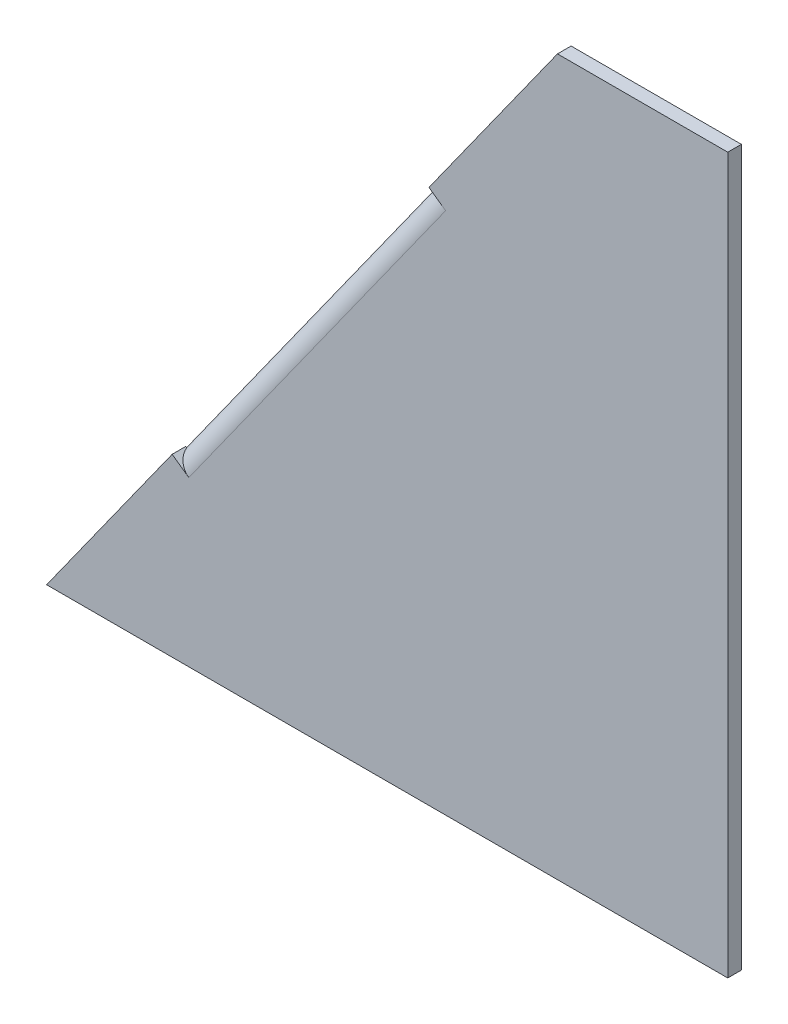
ISO-10303-21;
HEADER;
FILE_DESCRIPTION(('STEP AP214'),'2;1');
FILE_NAME('part.step','',(''),(''),'','','');
FILE_SCHEMA(('AUTOMOTIVE_DESIGN { 1 0 10303 214 1 1 1 1 }'));
ENDSEC;
DATA;
#1=APPLICATION_CONTEXT('core data for automotive mechanical design processes');
#2=APPLICATION_PROTOCOL_DEFINITION('international standard','automotive_design',2000,#1);
#3=PRODUCT_CONTEXT('',#1,'mechanical');
#4=PRODUCT('Part','Part','',(#3));
#5=PRODUCT_RELATED_PRODUCT_CATEGORY('part','',(#4));
#6=PRODUCT_DEFINITION_FORMATION('','',#4);
#7=PRODUCT_DEFINITION_CONTEXT('part definition',#1,'design');
#8=PRODUCT_DEFINITION('design','',#6,#7);
#9=PRODUCT_DEFINITION_SHAPE('','',#8);
#10=(LENGTH_UNIT() NAMED_UNIT(*) SI_UNIT(.MILLI.,.METRE.));
#11=(NAMED_UNIT(*) PLANE_ANGLE_UNIT() SI_UNIT($,.RADIAN.));
#12=(NAMED_UNIT(*) SI_UNIT($,.STERADIAN.) SOLID_ANGLE_UNIT());
#13=UNCERTAINTY_MEASURE_WITH_UNIT(LENGTH_MEASURE(1.E-05),#10,'distance_accuracy_value','');
#14=(GEOMETRIC_REPRESENTATION_CONTEXT(3) GLOBAL_UNCERTAINTY_ASSIGNED_CONTEXT((#13)) GLOBAL_UNIT_ASSIGNED_CONTEXT((#10,
#11,#12)) REPRESENTATION_CONTEXT('',''));
#15=CARTESIAN_POINT('',(0.,0.,0.));
#16=DIRECTION('',(0.,0.,1.));
#17=DIRECTION('',(1.,0.,0.));
#18=AXIS2_PLACEMENT_3D('',#15,#16,#17);
#19=CARTESIAN_POINT('',(-79.126040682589,24.0621478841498,-2.));
#20=DIRECTION('',(0.581238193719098,0.813733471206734,0.));
#21=DIRECTION('',(-0.813733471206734,0.581238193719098,0.));
#22=AXIS2_PLACEMENT_3D('',#19,#20,#21);
#23=PLANE('',#22);
#24=DIRECTION('',(-0.813733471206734,0.581238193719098,0.));
#25=VECTOR('',#24,1.);
#26=CARTESIAN_POINT('',(-81.5672410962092,25.8058624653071,0.));
#27=LINE('',#26,#25);
#28=CARTESIAN_POINT('',(-79.126040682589,24.0621478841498,0.));
#29=VERTEX_POINT('',#28);
#30=CARTESIAN_POINT('',(-81.5672410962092,25.8058624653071,0.));
#31=VERTEX_POINT('',#30);
#32=EDGE_CURVE('E39',#29,#31,#27,.T.);
#33=ORIENTED_EDGE('',*,*,#32,.F.);
#34=CARTESIAN_POINT('',(-79.126040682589,24.0621478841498,-3.));
#35=DIRECTION('',(0.581238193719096,0.813733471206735,0.));
#36=DIRECTION('',(-0.813733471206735,0.581238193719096,0.));
#37=AXIS2_PLACEMENT_3D('',#34,#35,#36);
#38=CIRCLE('',#37,3.);
#39=CARTESIAN_POINT('',(-81.427626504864,25.7061377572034,-1.99999999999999));
#40=VERTEX_POINT('',#39);
#41=EDGE_CURVE('E140',#29,#40,#38,.F.);
#42=ORIENTED_EDGE('',*,*,#41,.T.);
#43=DIRECTION('',(-0.813733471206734,0.581238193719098,0.));
#44=VECTOR('',#43,1.);
#45=CARTESIAN_POINT('',(-79.126040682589,24.0621478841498,-2.));
#46=LINE('',#45,#44);
#47=CARTESIAN_POINT('',(-81.5672410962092,25.8058624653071,-2.));
#48=VERTEX_POINT('',#47);
#49=EDGE_CURVE('E202',#40,#48,#46,.T.);
#50=ORIENTED_EDGE('',*,*,#49,.T.);
#51=DIRECTION('',(0.,0.,1.));
#52=VECTOR('',#51,1.);
#53=CARTESIAN_POINT('',(-81.5672410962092,25.8058624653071,-2.));
#54=LINE('',#53,#52);
#55=EDGE_CURVE('E150',#48,#31,#54,.T.);
#56=ORIENTED_EDGE('',*,*,#55,.T.);
#57=EDGE_LOOP('',(#33,#42,#50,#56));
#58=FACE_BOUND('',#57,.T.);
#59=ADVANCED_FACE('F35',(#58),#23,.T.);
#60=CARTESIAN_POINT('',(-43.8627472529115,78.5921538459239,-2.));
#61=DIRECTION('',(-0.581238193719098,-0.813733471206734,0.));
#62=DIRECTION('',(0.813733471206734,-0.581238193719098,0.));
#63=AXIS2_PLACEMENT_3D('',#60,#61,#62);
#64=PLANE('',#63);
#65=DIRECTION('',(0.813733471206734,-0.581238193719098,0.));
#66=VECTOR('',#65,1.);
#67=CARTESIAN_POINT('',(-43.8627472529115,78.5921538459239,-2.));
#68=LINE('',#67,#66);
#69=CARTESIAN_POINT('',(-43.8627472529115,78.5921538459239,-2.));
#70=VERTEX_POINT('',#69);
#71=CARTESIAN_POINT('',(-43.7231326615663,78.4924291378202,-2.));
#72=VERTEX_POINT('',#71);
#73=EDGE_CURVE('E203',#70,#72,#68,.T.);
#74=ORIENTED_EDGE('',*,*,#73,.T.);
#75=CARTESIAN_POINT('',(-41.4215468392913,76.8484392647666,-3.));
#76=DIRECTION('',(0.581238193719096,0.813733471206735,0.));
#77=DIRECTION('',(-0.813733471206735,0.581238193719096,0.));
#78=AXIS2_PLACEMENT_3D('',#75,#76,#77);
#79=CIRCLE('',#78,3.);
#80=CARTESIAN_POINT('',(-41.4215468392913,76.8484392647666,0.));
#81=VERTEX_POINT('',#80);
#82=EDGE_CURVE('E11',#72,#81,#79,.T.);
#83=ORIENTED_EDGE('',*,*,#82,.T.);
#84=DIRECTION('',(0.813733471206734,-0.581238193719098,0.));
#85=VECTOR('',#84,1.);
#86=CARTESIAN_POINT('',(-43.8627472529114,78.5921538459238,0.));
#87=LINE('',#86,#85);
#88=CARTESIAN_POINT('',(-43.8627472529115,78.5921538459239,0.));
#89=VERTEX_POINT('',#88);
#90=EDGE_CURVE('E153',#89,#81,#87,.T.);
#91=ORIENTED_EDGE('',*,*,#90,.F.);
#92=DIRECTION('',(0.,0.,1.));
#93=VECTOR('',#92,1.);
#94=CARTESIAN_POINT('',(-43.8627472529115,78.5921538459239,-2.));
#95=LINE('',#94,#93);
#96=EDGE_CURVE('E198',#70,#89,#95,.T.);
#97=ORIENTED_EDGE('',*,*,#96,.F.);
#98=EDGE_LOOP('',(#74,#83,#91,#97));
#99=FACE_BOUND('',#98,.T.);
#100=ADVANCED_FACE('F255',(#99),#64,.T.);
#101=CARTESIAN_POINT('',(-25.,105.,-2.));
#102=DIRECTION('',(-0.813733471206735,0.581238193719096,0.));
#103=DIRECTION('',(-0.581238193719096,-0.813733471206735,0.));
#104=AXIS2_PLACEMENT_3D('',#101,#102,#103);
#105=PLANE('',#104);
#106=DIRECTION('',(-0.581238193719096,-0.813733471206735,0.));
#107=VECTOR('',#106,1.);
#108=CARTESIAN_POINT('',(-25.,105.,0.));
#109=LINE('',#108,#107);
#110=CARTESIAN_POINT('',(-100.,0.,0.));
#111=VERTEX_POINT('',#110);
#112=EDGE_CURVE('E210',#31,#111,#109,.T.);
#113=ORIENTED_EDGE('',*,*,#112,.F.);
#114=ORIENTED_EDGE('',*,*,#55,.F.);
#115=DIRECTION('',(-0.581238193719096,-0.813733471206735,0.));
#116=VECTOR('',#115,1.);
#117=CARTESIAN_POINT('',(-25.,105.,-2.));
#118=LINE('',#117,#116);
#119=CARTESIAN_POINT('',(-100.,0.,-2.));
#120=VERTEX_POINT('',#119);
#121=EDGE_CURVE('E87',#48,#120,#118,.T.);
#122=ORIENTED_EDGE('',*,*,#121,.T.);
#123=DIRECTION('',(0.,0.,1.));
#124=VECTOR('',#123,1.);
#125=CARTESIAN_POINT('',(-100.,0.,-2.));
#126=LINE('',#125,#124);
#127=EDGE_CURVE('E221',#120,#111,#126,.T.);
#128=ORIENTED_EDGE('',*,*,#127,.T.);
#129=EDGE_LOOP('',(#113,#114,#122,#128));
#130=FACE_BOUND('',#129,.T.);
#131=ADVANCED_FACE('F37',(#130),#105,.T.);
#132=CARTESIAN_POINT('',(-25.,105.,-2.));
#133=VERTEX_POINT('',#132);
#134=EDGE_CURVE('E211',#133,#70,#118,.T.);
#135=ORIENTED_EDGE('',*,*,#134,.T.);
#136=ORIENTED_EDGE('',*,*,#96,.T.);
#137=CARTESIAN_POINT('',(-25.,105.,0.));
#138=VERTEX_POINT('',#137);
#139=EDGE_CURVE('E222',#138,#89,#109,.T.);
#140=ORIENTED_EDGE('',*,*,#139,.F.);
#141=DIRECTION('',(0.,0.,1.));
#142=VECTOR('',#141,1.);
#143=CARTESIAN_POINT('',(-25.,105.,-2.));
#144=LINE('',#143,#142);
#145=EDGE_CURVE('E60',#133,#138,#144,.T.);
#146=ORIENTED_EDGE('',*,*,#145,.F.);
#147=EDGE_LOOP('',(#135,#136,#140,#146));
#148=FACE_BOUND('',#147,.T.);
#149=ADVANCED_FACE('F253',(#148),#105,.T.);
#150=CARTESIAN_POINT('',(-100.,0.,-2.));
#151=DIRECTION('',(0.,0.,1.));
#152=DIRECTION('',(1.,0.,0.));
#153=AXIS2_PLACEMENT_3D('',#150,#151,#152);
#154=PLANE('',#153);
#155=CARTESIAN_POINT('',(-79.126040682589,24.0621478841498,-2.));
#156=VERTEX_POINT('',#155);
#157=EDGE_CURVE('E200',#156,#40,#46,.T.);
#158=ORIENTED_EDGE('',*,*,#157,.F.);
#159=DIRECTION('',(0.581238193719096,0.813733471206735,0.));
#160=VECTOR('',#159,1.);
#161=CARTESIAN_POINT('',(-41.4215468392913,76.8484392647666,-2.));
#162=LINE('',#161,#160);
#163=CARTESIAN_POINT('',(-41.4215468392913,76.8484392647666,-2.));
#164=VERTEX_POINT('',#163);
#165=EDGE_CURVE('E163',#164,#156,#162,.F.);
#166=ORIENTED_EDGE('',*,*,#165,.F.);
#167=EDGE_CURVE('E206',#72,#164,#68,.T.);
#168=ORIENTED_EDGE('',*,*,#167,.F.);
#169=ORIENTED_EDGE('',*,*,#73,.F.);
#170=ORIENTED_EDGE('',*,*,#134,.F.);
#171=DIRECTION('',(-1.,0.,0.));
#172=VECTOR('',#171,1.);
#173=CARTESIAN_POINT('',(0.,105.,-2.));
#174=LINE('',#173,#172);
#175=CARTESIAN_POINT('',(0.,105.,-2.));
#176=VERTEX_POINT('',#175);
#177=EDGE_CURVE('E219',#176,#133,#174,.T.);
#178=ORIENTED_EDGE('',*,*,#177,.F.);
#179=DIRECTION('',(0.,1.,0.));
#180=VECTOR('',#179,1.);
#181=CARTESIAN_POINT('',(0.,0.,-2.));
#182=LINE('',#181,#180);
#183=CARTESIAN_POINT('',(0.,0.,-2.));
#184=VERTEX_POINT('',#183);
#185=EDGE_CURVE('E216',#184,#176,#182,.T.);
#186=ORIENTED_EDGE('',*,*,#185,.F.);
#187=DIRECTION('',(1.,0.,0.));
#188=VECTOR('',#187,1.);
#189=CARTESIAN_POINT('',(-100.,0.,-2.));
#190=LINE('',#189,#188);
#191=EDGE_CURVE('E213',#120,#184,#190,.T.);
#192=ORIENTED_EDGE('',*,*,#191,.F.);
#193=ORIENTED_EDGE('',*,*,#121,.F.);
#194=ORIENTED_EDGE('',*,*,#49,.F.);
#195=EDGE_LOOP('',(#158,#166,#168,#169,#170,#178,#186,#192,#193,#194));
#196=FACE_BOUND('',#195,.T.);
#197=ADVANCED_FACE('F250',(#196),#154,.F.);
#198=CARTESIAN_POINT('',(-100.,0.,0.));
#199=DIRECTION('',(0.,0.,1.));
#200=DIRECTION('',(1.,0.,0.));
#201=AXIS2_PLACEMENT_3D('',#198,#199,#200);
#202=PLANE('',#201);
#203=DIRECTION('',(0.581238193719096,0.813733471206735,0.));
#204=VECTOR('',#203,1.);
#205=CARTESIAN_POINT('',(-41.4215468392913,76.8484392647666,0.));
#206=LINE('',#205,#204);
#207=EDGE_CURVE('E52',#81,#29,#206,.F.);
#208=ORIENTED_EDGE('',*,*,#207,.T.);
#209=ORIENTED_EDGE('',*,*,#32,.T.);
#210=ORIENTED_EDGE('',*,*,#112,.T.);
#211=DIRECTION('',(1.,0.,0.));
#212=VECTOR('',#211,1.);
#213=CARTESIAN_POINT('',(-100.,0.,0.));
#214=LINE('',#213,#212);
#215=CARTESIAN_POINT('',(0.,0.,0.));
#216=VERTEX_POINT('',#215);
#217=EDGE_CURVE('E224',#111,#216,#214,.T.);
#218=ORIENTED_EDGE('',*,*,#217,.T.);
#219=DIRECTION('',(0.,1.,0.));
#220=VECTOR('',#219,1.);
#221=CARTESIAN_POINT('',(0.,0.,0.));
#222=LINE('',#221,#220);
#223=CARTESIAN_POINT('',(0.,105.,0.));
#224=VERTEX_POINT('',#223);
#225=EDGE_CURVE('E227',#216,#224,#222,.T.);
#226=ORIENTED_EDGE('',*,*,#225,.T.);
#227=DIRECTION('',(-1.,0.,0.));
#228=VECTOR('',#227,1.);
#229=CARTESIAN_POINT('',(0.,105.,0.));
#230=LINE('',#229,#228);
#231=EDGE_CURVE('E230',#224,#138,#230,.T.);
#232=ORIENTED_EDGE('',*,*,#231,.T.);
#233=ORIENTED_EDGE('',*,*,#139,.T.);
#234=ORIENTED_EDGE('',*,*,#90,.T.);
#235=EDGE_LOOP('',(#208,#209,#210,#218,#226,#232,#233,#234));
#236=FACE_BOUND('',#235,.T.);
#237=ADVANCED_FACE('F155',(#236),#202,.T.);
#238=CARTESIAN_POINT('',(0.,105.,-2.));
#239=DIRECTION('',(0.,1.,0.));
#240=DIRECTION('',(0.,0.,1.));
#241=AXIS2_PLACEMENT_3D('',#238,#239,#240);
#242=PLANE('',#241);
#243=ORIENTED_EDGE('',*,*,#231,.F.);
#244=DIRECTION('',(0.,0.,1.));
#245=VECTOR('',#244,1.);
#246=CARTESIAN_POINT('',(0.,105.,-2.));
#247=LINE('',#246,#245);
#248=EDGE_CURVE('E234',#176,#224,#247,.T.);
#249=ORIENTED_EDGE('',*,*,#248,.F.);
#250=ORIENTED_EDGE('',*,*,#177,.T.);
#251=ORIENTED_EDGE('',*,*,#145,.T.);
#252=EDGE_LOOP('',(#243,#249,#250,#251));
#253=FACE_BOUND('',#252,.T.);
#254=ADVANCED_FACE('F244',(#253),#242,.T.);
#255=CARTESIAN_POINT('',(0.,0.,-2.));
#256=DIRECTION('',(1.,0.,0.));
#257=DIRECTION('',(0.,0.,-1.));
#258=AXIS2_PLACEMENT_3D('',#255,#256,#257);
#259=PLANE('',#258);
#260=ORIENTED_EDGE('',*,*,#225,.F.);
#261=DIRECTION('',(0.,0.,1.));
#262=VECTOR('',#261,1.);
#263=CARTESIAN_POINT('',(0.,0.,-2.));
#264=LINE('',#263,#262);
#265=EDGE_CURVE('E236',#184,#216,#264,.T.);
#266=ORIENTED_EDGE('',*,*,#265,.F.);
#267=ORIENTED_EDGE('',*,*,#185,.T.);
#268=ORIENTED_EDGE('',*,*,#248,.T.);
#269=EDGE_LOOP('',(#260,#266,#267,#268));
#270=FACE_BOUND('',#269,.T.);
#271=ADVANCED_FACE('F247',(#270),#259,.T.);
#272=CARTESIAN_POINT('',(-100.,0.,-2.));
#273=DIRECTION('',(0.,-1.,0.));
#274=DIRECTION('',(0.,0.,-1.));
#275=AXIS2_PLACEMENT_3D('',#272,#273,#274);
#276=PLANE('',#275);
#277=ORIENTED_EDGE('',*,*,#217,.F.);
#278=ORIENTED_EDGE('',*,*,#127,.F.);
#279=ORIENTED_EDGE('',*,*,#191,.T.);
#280=ORIENTED_EDGE('',*,*,#265,.T.);
#281=EDGE_LOOP('',(#277,#278,#279,#280));
#282=FACE_BOUND('',#281,.T.);
#283=ADVANCED_FACE('F241',(#282),#276,.T.);
#284=CARTESIAN_POINT('',(-38.5734796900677,74.8141055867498,-6.));
#285=DIRECTION('',(-0.581238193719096,-0.813733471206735,0.));
#286=DIRECTION('',(-0.813733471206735,0.581238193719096,0.));
#287=AXIS2_PLACEMENT_3D('',#284,#285,#286);
#288=PLANE('',#287);
#289=DIRECTION('',(0.,0.,-1.));
#290=VECTOR('',#289,1.);
#291=CARTESIAN_POINT('',(-41.4215468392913,76.8484392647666,-6.));
#292=LINE('',#291,#290);
#293=CARTESIAN_POINT('',(-41.4215468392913,76.8484392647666,-4.));
#294=VERTEX_POINT('',#293);
#295=CARTESIAN_POINT('',(-41.4215468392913,76.8484392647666,-6.));
#296=VERTEX_POINT('',#295);
#297=EDGE_CURVE('E192',#294,#296,#292,.T.);
#298=ORIENTED_EDGE('',*,*,#297,.F.);
#299=DIRECTION('',(-0.813733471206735,0.581238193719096,0.));
#300=VECTOR('',#299,1.);
#301=CARTESIAN_POINT('',(-38.5734796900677,74.8141055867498,-4.));
#302=LINE('',#301,#300);
#303=CARTESIAN_POINT('',(-35.7254125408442,72.7797719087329,-4.));
#304=VERTEX_POINT('',#303);
#305=EDGE_CURVE('E183',#304,#294,#302,.T.);
#306=ORIENTED_EDGE('',*,*,#305,.F.);
#307=DIRECTION('',(0.,0.,-1.));
#308=VECTOR('',#307,1.);
#309=CARTESIAN_POINT('',(-35.7254125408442,72.7797719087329,-6.));
#310=LINE('',#309,#308);
#311=CARTESIAN_POINT('',(-35.7254125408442,72.7797719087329,-6.));
#312=VERTEX_POINT('',#311);
#313=EDGE_CURVE('E190',#304,#312,#310,.T.);
#314=ORIENTED_EDGE('',*,*,#313,.T.);
#315=DIRECTION('',(-0.813733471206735,0.581238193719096,0.));
#316=VECTOR('',#315,1.);
#317=CARTESIAN_POINT('',(-38.5734796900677,74.8141055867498,-6.));
#318=LINE('',#317,#316);
#319=EDGE_CURVE('E172',#312,#296,#318,.T.);
#320=ORIENTED_EDGE('',*,*,#319,.T.);
#321=EDGE_LOOP('',(#298,#306,#314,#320));
#322=FACE_BOUND('',#321,.T.);
#323=ADVANCED_FACE('F277',(#322),#288,.F.);
#324=CARTESIAN_POINT('',(-54.577659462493,46.3866262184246,-6.));
#325=DIRECTION('',(-0.813733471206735,0.581238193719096,0.));
#326=DIRECTION('',(0.581238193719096,0.813733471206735,0.));
#327=AXIS2_PLACEMENT_3D('',#324,#325,#326);
#328=PLANE('',#327);
#329=ORIENTED_EDGE('',*,*,#313,.F.);
#330=DIRECTION('',(0.581238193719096,0.813733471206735,0.));
#331=VECTOR('',#330,1.);
#332=CARTESIAN_POINT('',(-54.577659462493,46.3866262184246,-4.));
#333=LINE('',#332,#331);
#334=CARTESIAN_POINT('',(-73.4299063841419,19.9934805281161,-4.));
#335=VERTEX_POINT('',#334);
#336=EDGE_CURVE('E180',#335,#304,#333,.T.);
#337=ORIENTED_EDGE('',*,*,#336,.F.);
#338=DIRECTION('',(0.,0.,-1.));
#339=VECTOR('',#338,1.);
#340=CARTESIAN_POINT('',(-73.4299063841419,19.9934805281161,-6.));
#341=LINE('',#340,#339);
#342=CARTESIAN_POINT('',(-73.4299063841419,19.9934805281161,-6.));
#343=VERTEX_POINT('',#342);
#344=EDGE_CURVE('E171',#335,#343,#341,.T.);
#345=ORIENTED_EDGE('',*,*,#344,.T.);
#346=DIRECTION('',(0.581238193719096,0.813733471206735,0.));
#347=VECTOR('',#346,1.);
#348=CARTESIAN_POINT('',(-54.577659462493,46.3866262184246,-6.));
#349=LINE('',#348,#347);
#350=EDGE_CURVE('E168',#343,#312,#349,.T.);
#351=ORIENTED_EDGE('',*,*,#350,.T.);
#352=EDGE_LOOP('',(#329,#337,#345,#351));
#353=FACE_BOUND('',#352,.T.);
#354=ADVANCED_FACE('F281',(#353),#328,.F.);
#355=CARTESIAN_POINT('',(-76.2779735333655,22.027814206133,-6.));
#356=DIRECTION('',(0.581238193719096,0.813733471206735,0.));
#357=DIRECTION('',(0.813733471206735,-0.581238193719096,0.));
#358=AXIS2_PLACEMENT_3D('',#355,#356,#357);
#359=PLANE('',#358);
#360=DIRECTION('',(0.813733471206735,-0.581238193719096,0.));
#361=VECTOR('',#360,1.);
#362=CARTESIAN_POINT('',(-76.2779735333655,22.027814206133,-4.));
#363=LINE('',#362,#361);
#364=CARTESIAN_POINT('',(-79.126040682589,24.0621478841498,-4.));
#365=VERTEX_POINT('',#364);
#366=EDGE_CURVE('E147',#365,#335,#363,.T.);
#367=ORIENTED_EDGE('',*,*,#366,.F.);
#368=DIRECTION('',(0.,0.,-1.));
#369=VECTOR('',#368,1.);
#370=CARTESIAN_POINT('',(-79.126040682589,24.0621478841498,-6.));
#371=LINE('',#370,#369);
#372=CARTESIAN_POINT('',(-79.126040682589,24.0621478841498,-6.));
#373=VERTEX_POINT('',#372);
#374=EDGE_CURVE('E195',#365,#373,#371,.T.);
#375=ORIENTED_EDGE('',*,*,#374,.T.);
#376=DIRECTION('',(0.813733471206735,-0.581238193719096,0.));
#377=VECTOR('',#376,1.);
#378=CARTESIAN_POINT('',(-76.2779735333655,22.027814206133,-6.));
#379=LINE('',#378,#377);
#380=EDGE_CURVE('E177',#373,#343,#379,.T.);
#381=ORIENTED_EDGE('',*,*,#380,.T.);
#382=ORIENTED_EDGE('',*,*,#344,.F.);
#383=EDGE_LOOP('',(#367,#375,#381,#382));
#384=FACE_BOUND('',#383,.T.);
#385=ADVANCED_FACE('F271',(#384),#359,.F.);
#386=CARTESIAN_POINT('',(-57.4257266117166,48.4209598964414,-6.));
#387=DIRECTION('',(0.,0.,-1.));
#388=DIRECTION('',(-1.,0.,0.));
#389=AXIS2_PLACEMENT_3D('',#386,#387,#388);
#390=PLANE('',#389);
#391=ORIENTED_EDGE('',*,*,#350,.F.);
#392=ORIENTED_EDGE('',*,*,#380,.F.);
#393=DIRECTION('',(-0.581238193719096,-0.813733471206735,0.));
#394=VECTOR('',#393,1.);
#395=CARTESIAN_POINT('',(-60.2737937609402,50.4552935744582,-6.));
#396=LINE('',#395,#394);
#397=EDGE_CURVE('E175',#296,#373,#396,.T.);
#398=ORIENTED_EDGE('',*,*,#397,.F.);
#399=ORIENTED_EDGE('',*,*,#319,.F.);
#400=EDGE_LOOP('',(#391,#392,#398,#399));
#401=FACE_BOUND('',#400,.T.);
#402=ADVANCED_FACE('F275',(#401),#390,.T.);
#403=CARTESIAN_POINT('',(-57.4257266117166,48.4209598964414,-4.));
#404=DIRECTION('',(0.,0.,-1.));
#405=DIRECTION('',(-1.,0.,0.));
#406=AXIS2_PLACEMENT_3D('',#403,#404,#405);
#407=PLANE('',#406);
#408=ORIENTED_EDGE('',*,*,#336,.T.);
#409=ORIENTED_EDGE('',*,*,#305,.T.);
#410=DIRECTION('',(-0.581238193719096,-0.813733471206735,0.));
#411=VECTOR('',#410,1.);
#412=CARTESIAN_POINT('',(-60.2737937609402,50.4552935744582,-4.));
#413=LINE('',#412,#411);
#414=EDGE_CURVE('E186',#294,#365,#413,.T.);
#415=ORIENTED_EDGE('',*,*,#414,.T.);
#416=ORIENTED_EDGE('',*,*,#366,.T.);
#417=EDGE_LOOP('',(#408,#409,#415,#416));
#418=FACE_BOUND('',#417,.T.);
#419=ADVANCED_FACE('F283',(#418),#407,.F.);
#420=CARTESIAN_POINT('',(-79.126040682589,24.0621478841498,-3.));
#421=DIRECTION('',(-0.581238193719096,-0.813733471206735,0.));
#422=DIRECTION('',(0.813733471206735,-0.581238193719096,0.));
#423=AXIS2_PLACEMENT_3D('',#420,#421,#422);
#424=PLANE('',#423);
#425=CARTESIAN_POINT('',(-79.126040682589,24.0621478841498,-3.));
#426=DIRECTION('',(0.581238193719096,0.813733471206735,0.));
#427=DIRECTION('',(-0.813733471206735,0.581238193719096,0.));
#428=AXIS2_PLACEMENT_3D('',#425,#426,#427);
#429=CIRCLE('',#428,1.);
#430=EDGE_CURVE('E159',#156,#365,#429,.F.);
#431=ORIENTED_EDGE('',*,*,#430,.F.);
#432=ORIENTED_EDGE('',*,*,#157,.T.);
#433=EDGE_CURVE('E144',#40,#373,#38,.F.);
#434=ORIENTED_EDGE('',*,*,#433,.T.);
#435=ORIENTED_EDGE('',*,*,#374,.F.);
#436=EDGE_LOOP('',(#431,#432,#434,#435));
#437=FACE_BOUND('',#436,.T.);
#438=ADVANCED_FACE('F267',(#437),#424,.T.);
#439=CARTESIAN_POINT('',(-41.4215468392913,76.8484392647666,-3.));
#440=DIRECTION('',(-0.581238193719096,-0.813733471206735,0.));
#441=DIRECTION('',(0.813733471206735,-0.581238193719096,0.));
#442=AXIS2_PLACEMENT_3D('',#439,#440,#441);
#443=PLANE('',#442);
#444=EDGE_CURVE('E45',#296,#72,#79,.T.);
#445=ORIENTED_EDGE('',*,*,#444,.T.);
#446=ORIENTED_EDGE('',*,*,#167,.T.);
#447=CARTESIAN_POINT('',(-41.4215468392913,76.8484392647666,-3.));
#448=DIRECTION('',(0.581238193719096,0.813733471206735,0.));
#449=DIRECTION('',(-0.813733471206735,0.581238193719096,0.));
#450=AXIS2_PLACEMENT_3D('',#447,#448,#449);
#451=CIRCLE('',#450,1.);
#452=EDGE_CURVE('E165',#294,#164,#451,.T.);
#453=ORIENTED_EDGE('',*,*,#452,.F.);
#454=ORIENTED_EDGE('',*,*,#297,.T.);
#455=EDGE_LOOP('',(#445,#446,#453,#454));
#456=FACE_BOUND('',#455,.T.);
#457=ADVANCED_FACE('F258',(#456),#443,.F.);
#458=CARTESIAN_POINT('',(-41.4215468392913,76.8484392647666,-3.));
#459=DIRECTION('',(0.581238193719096,0.813733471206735,0.));
#460=DIRECTION('',(0.,0.,-1.));
#461=AXIS2_PLACEMENT_3D('',#458,#459,#460);
#462=CYLINDRICAL_SURFACE('',#461,3.);
#463=ORIENTED_EDGE('',*,*,#207,.F.);
#464=ORIENTED_EDGE('',*,*,#82,.F.);
#465=ORIENTED_EDGE('',*,*,#444,.F.);
#466=ORIENTED_EDGE('',*,*,#397,.T.);
#467=ORIENTED_EDGE('',*,*,#433,.F.);
#468=ORIENTED_EDGE('',*,*,#41,.F.);
#469=EDGE_LOOP('',(#463,#464,#465,#466,#467,#468));
#470=FACE_BOUND('',#469,.T.);
#471=ADVANCED_FACE('F142',(#470),#462,.T.);
#472=CARTESIAN_POINT('',(-41.4215468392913,76.8484392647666,-3.));
#473=DIRECTION('',(0.581238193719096,0.813733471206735,0.));
#474=DIRECTION('',(0.,0.,-1.));
#475=AXIS2_PLACEMENT_3D('',#472,#473,#474);
#476=CYLINDRICAL_SURFACE('',#475,1.);
#477=ORIENTED_EDGE('',*,*,#165,.T.);
#478=ORIENTED_EDGE('',*,*,#430,.T.);
#479=ORIENTED_EDGE('',*,*,#414,.F.);
#480=ORIENTED_EDGE('',*,*,#452,.T.);
#481=EDGE_LOOP('',(#477,#478,#479,#480));
#482=FACE_BOUND('',#481,.T.);
#483=ADVANCED_FACE('F263',(#482),#476,.F.);
#484=CLOSED_SHELL('',(#59,#100,#131,#149,#197,#237,#254,#271,#283,#323,#354,#385,#402,#419,#438,
#457,#471,#483));
#485=MANIFOLD_SOLID_BREP('B2',#484);
#486=ADVANCED_BREP_SHAPE_REPRESENTATION('',(#18,#485),#14);
#487=SHAPE_DEFINITION_REPRESENTATION(#9,#486);
ENDSEC;
END-ISO-10303-21;
